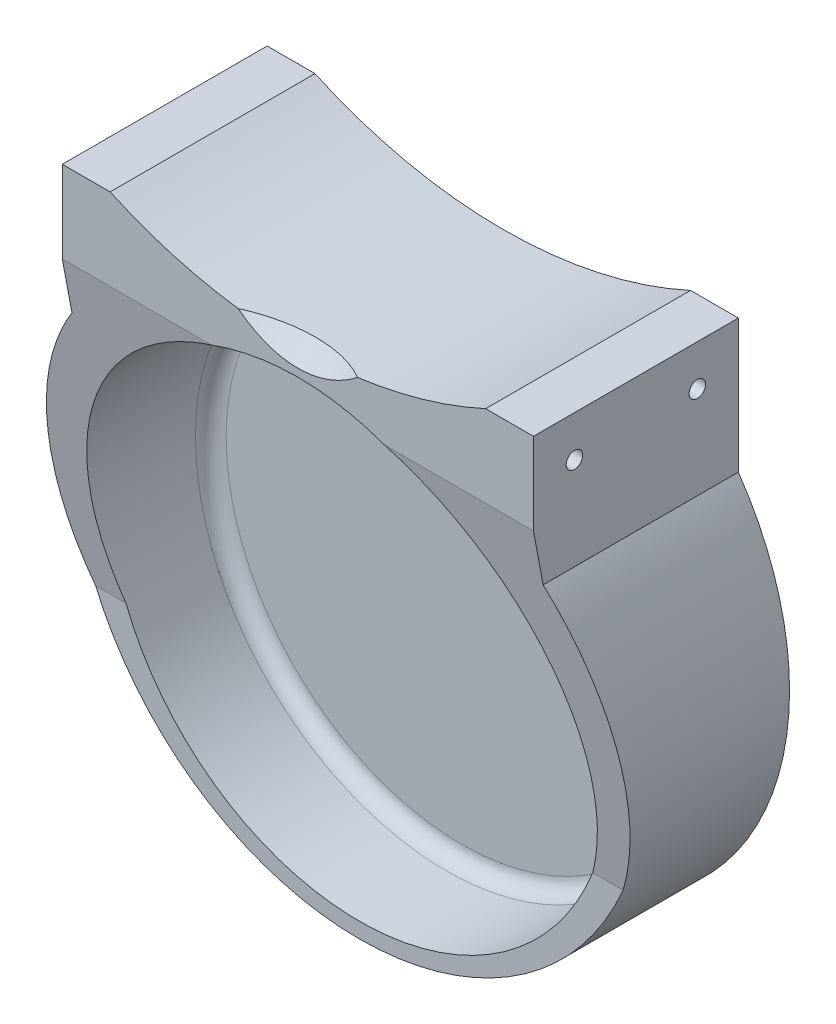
ISO-10303-21;
HEADER;
FILE_DESCRIPTION(('STEP AP214'),'2;1');
FILE_NAME('part.step','',(''),(''),'','','');
FILE_SCHEMA(('AUTOMOTIVE_DESIGN { 1 0 10303 214 1 1 1 1 }'));
ENDSEC;
DATA;
#1=APPLICATION_CONTEXT('core data for automotive mechanical design processes');
#2=APPLICATION_PROTOCOL_DEFINITION('international standard','automotive_design',2000,#1);
#3=PRODUCT_CONTEXT('',#1,'mechanical');
#4=PRODUCT('Part','Part','',(#3));
#5=PRODUCT_RELATED_PRODUCT_CATEGORY('part','',(#4));
#6=PRODUCT_DEFINITION_FORMATION('','',#4);
#7=PRODUCT_DEFINITION_CONTEXT('part definition',#1,'design');
#8=PRODUCT_DEFINITION('design','',#6,#7);
#9=PRODUCT_DEFINITION_SHAPE('','',#8);
#10=(LENGTH_UNIT() NAMED_UNIT(*) SI_UNIT(.MILLI.,.METRE.));
#11=(NAMED_UNIT(*) PLANE_ANGLE_UNIT() SI_UNIT($,.RADIAN.));
#12=(NAMED_UNIT(*) SI_UNIT($,.STERADIAN.) SOLID_ANGLE_UNIT());
#13=UNCERTAINTY_MEASURE_WITH_UNIT(LENGTH_MEASURE(1.E-05),#10,'distance_accuracy_value','');
#14=(GEOMETRIC_REPRESENTATION_CONTEXT(3) GLOBAL_UNCERTAINTY_ASSIGNED_CONTEXT((#13)) GLOBAL_UNIT_ASSIGNED_CONTEXT((#10,
#11,#12)) REPRESENTATION_CONTEXT('',''));
#15=CARTESIAN_POINT('',(0.,0.,0.));
#16=DIRECTION('',(0.,0.,1.));
#17=DIRECTION('',(1.,0.,0.));
#18=AXIS2_PLACEMENT_3D('',#15,#16,#17);
#19=CARTESIAN_POINT('',(0.,225.425,63.5));
#20=DIRECTION('',(0.,0.,-1.));
#21=DIRECTION('',(-1.,0.,0.));
#22=AXIS2_PLACEMENT_3D('',#19,#20,#21);
#23=CYLINDRICAL_SURFACE('',#22,139.7);
#24=CARTESIAN_POINT('',(18.4892893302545,86.9539337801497,63.5));
#25=CARTESIAN_POINT('',(18.0983778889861,86.9017353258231,63.2453553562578));
#26=CARTESIAN_POINT('',(17.7023084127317,86.8505373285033,62.9984136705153));
#27=CARTESIAN_POINT('',(16.9003627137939,86.7504497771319,62.5204614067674));
#28=CARTESIAN_POINT('',(16.4944860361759,86.7015603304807,62.2894515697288));
#29=CARTESIAN_POINT('',(15.6733590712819,86.6063892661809,61.8438508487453));
#30=CARTESIAN_POINT('',(15.2581062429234,86.5601083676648,61.6292644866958));
#31=CARTESIAN_POINT('',(14.418976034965,86.4704704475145,61.2170982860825));
#32=CARTESIAN_POINT('',(13.9950987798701,86.4271133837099,61.0195182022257));
#33=CARTESIAN_POINT('',(12.7108256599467,86.3018013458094,60.4527301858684));
#34=CARTESIAN_POINT('',(11.8382030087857,86.2246540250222,60.1096997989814));
#35=CARTESIAN_POINT('',(10.0666002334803,86.0853316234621,59.4970539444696));
#36=CARTESIAN_POINT('',(9.16762310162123,86.0231548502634,59.227430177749));
#37=CARTESIAN_POINT('',(7.34738700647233,85.9153637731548,58.7636623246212));
#38=CARTESIAN_POINT('',(6.42608580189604,85.8697839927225,58.5696755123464));
#39=CARTESIAN_POINT('',(4.5696641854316,85.7966679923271,58.2599367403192));
#40=CARTESIAN_POINT('',(3.63454310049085,85.769132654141,58.1441886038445));
#41=CARTESIAN_POINT('',(1.75830464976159,85.7329173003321,57.9921733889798));
#42=CARTESIAN_POINT('',(0.81719315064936,85.7242210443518,57.9558378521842));
#43=CARTESIAN_POINT('',(-1.06467513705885,85.725888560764,57.9628167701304));
#44=CARTESIAN_POINT('',(-2.00543194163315,85.7362513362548,58.0061270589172));
#45=CARTESIAN_POINT('',(-3.854869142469,85.7752130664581,58.1697624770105));
#46=CARTESIAN_POINT('',(-4.76374257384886,85.8033253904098,58.2880327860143));
#47=CARTESIAN_POINT('',(-6.56812619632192,85.8765674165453,58.5985395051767));
#48=CARTESIAN_POINT('',(-7.46363556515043,85.9216981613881,58.7907804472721));
#49=CARTESIAN_POINT('',(-9.23509271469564,86.0277595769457,59.2473915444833));
#50=CARTESIAN_POINT('',(-10.1110398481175,86.0886907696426,59.5117640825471));
#51=CARTESIAN_POINT('',(-11.837486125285,86.224736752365,60.110126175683));
#52=CARTESIAN_POINT('',(-12.6879926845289,86.2998473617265,60.4440952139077));
#53=CARTESIAN_POINT('',(-13.9554902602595,86.4231172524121,61.0013467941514));
#54=CARTESIAN_POINT('',(-14.3837682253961,86.4668083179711,61.2003504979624));
#55=CARTESIAN_POINT('',(-15.2315471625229,86.5571794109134,61.6157120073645));
#56=CARTESIAN_POINT('',(-15.6510479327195,86.6038595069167,61.8320702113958));
#57=CARTESIAN_POINT('',(-16.4794998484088,86.69976977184,62.2810069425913));
#58=CARTESIAN_POINT('',(-16.8884762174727,86.7489927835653,62.5135405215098));
#59=CARTESIAN_POINT('',(-17.6964760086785,86.8497834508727,62.9947777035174));
#60=CARTESIAN_POINT('',(-18.0954999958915,86.9013509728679,63.2434803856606));
#61=CARTESIAN_POINT('',(-18.4892893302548,86.9539337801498,63.5));
#62=B_SPLINE_CURVE_WITH_KNOTS('',3,(#24,#25,#26,#27,#28,#29,#30,#31,#32,#33,#34,#35,#36,#37,#38,
#39,#40,#41,#42,#43,#44,#45,#46,#47,#48,#49,#50,#51,#52,#53,#54,#55,#56,#57,#58,#59,#60,#61),
.UNSPECIFIED.,.F.,.F.,(4,2,2,2,2,2,2,2,2,2,2,2,2,2,2,2,2,2,4),(0.,1.40825427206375,
2.81657399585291,4.22528008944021,5.63396586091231,8.452756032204,11.271227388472,
14.095528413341,16.9199674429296,19.7419706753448,22.5638263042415,25.3114894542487,
28.0593209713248,30.8072432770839,33.5543566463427,34.9768322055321,36.399340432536,
37.8180425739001,39.2366639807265),.UNSPECIFIED.);
#63=CARTESIAN_POINT('',(18.4892893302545,86.9539337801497,63.5));
#64=VERTEX_POINT('',#63);
#65=CARTESIAN_POINT('',(-18.4892893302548,86.9539337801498,63.5));
#66=VERTEX_POINT('',#65);
#67=EDGE_CURVE('E11',#64,#66,#62,.T.);
#68=ORIENTED_EDGE('',*,*,#67,.F.);
#69=CARTESIAN_POINT('',(0.,225.425,63.5));
#70=DIRECTION('',(0.,0.,-1.));
#71=DIRECTION('',(-1.,0.,0.));
#72=AXIS2_PLACEMENT_3D('',#69,#70,#71);
#73=CIRCLE('',#72,139.7);
#74=CARTESIAN_POINT('',(58.1987113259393,98.425,63.5));
#75=VERTEX_POINT('',#74);
#76=EDGE_CURVE('E145',#75,#64,#73,.T.);
#77=ORIENTED_EDGE('',*,*,#76,.F.);
#78=DIRECTION('',(0.,0.,-1.));
#79=VECTOR('',#78,1.);
#80=CARTESIAN_POINT('',(58.1987113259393,98.425,63.5));
#81=LINE('',#80,#79);
#82=CARTESIAN_POINT('',(58.1987113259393,98.425,0.));
#83=VERTEX_POINT('',#82);
#84=EDGE_CURVE('E221',#83,#75,#81,.F.);
#85=ORIENTED_EDGE('',*,*,#84,.F.);
#86=CARTESIAN_POINT('',(0.,225.425,0.));
#87=DIRECTION('',(0.,0.,-1.));
#88=DIRECTION('',(-1.,0.,0.));
#89=AXIS2_PLACEMENT_3D('',#86,#87,#88);
#90=CIRCLE('',#89,139.7);
#91=CARTESIAN_POINT('',(-58.1987113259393,98.425,0.));
#92=VERTEX_POINT('',#91);
#93=EDGE_CURVE('E151',#83,#92,#90,.T.);
#94=ORIENTED_EDGE('',*,*,#93,.T.);
#95=DIRECTION('',(0.,0.,-1.));
#96=VECTOR('',#95,1.);
#97=CARTESIAN_POINT('',(-58.1987113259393,98.425,63.5));
#98=LINE('',#97,#96);
#99=CARTESIAN_POINT('',(-58.1987113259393,98.425,63.5));
#100=VERTEX_POINT('',#99);
#101=EDGE_CURVE('E149',#100,#92,#98,.T.);
#102=ORIENTED_EDGE('',*,*,#101,.F.);
#103=EDGE_CURVE('E142',#66,#100,#73,.T.);
#104=ORIENTED_EDGE('',*,*,#103,.F.);
#105=EDGE_LOOP('',(#68,#77,#85,#94,#102,#104));
#106=FACE_BOUND('',#105,.T.);
#107=ADVANCED_FACE('F39',(#106),#23,.F.);
#108=CARTESIAN_POINT('',(0.,6.34999999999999,63.5));
#109=DIRECTION('',(0.,0.,-1.));
#110=DIRECTION('',(-1.,0.,0.));
#111=AXIS2_PLACEMENT_3D('',#108,#109,#110);
#112=CYLINDRICAL_SURFACE('',#111,88.9);
#113=CARTESIAN_POINT('',(0.,6.34999999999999,50.9984375));
#114=DIRECTION('',(0.,0.184288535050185,-0.982872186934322));
#115=DIRECTION('',(0.,-0.982872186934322,-0.184288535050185));
#116=AXIS2_PLACEMENT_3D('',#113,#114,#115);
#117=ELLIPSE('',#116,90.449196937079,88.9);
#118=CARTESIAN_POINT('',(-81.7523967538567,-28.575,44.45));
#119=VERTEX_POINT('',#118);
#120=CARTESIAN_POINT('',(-73.025,57.0506841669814,60.504815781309));
#121=VERTEX_POINT('',#120);
#122=EDGE_CURVE('E230',#119,#121,#117,.T.);
#123=ORIENTED_EDGE('',*,*,#122,.T.);
#124=DIRECTION('',(0.,0.,-1.));
#125=VECTOR('',#124,1.);
#126=CARTESIAN_POINT('',(-73.025,57.0506841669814,63.5));
#127=LINE('',#126,#125);
#128=CARTESIAN_POINT('',(-73.025,57.0506841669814,0.));
#129=VERTEX_POINT('',#128);
#130=EDGE_CURVE('E210',#121,#129,#127,.T.);
#131=ORIENTED_EDGE('',*,*,#130,.T.);
#132=CARTESIAN_POINT('',(0.,6.34999999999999,0.));
#133=DIRECTION('',(0.,0.,1.));
#134=DIRECTION('',(1.,0.,0.));
#135=AXIS2_PLACEMENT_3D('',#132,#133,#134);
#136=CIRCLE('',#135,88.9);
#137=CARTESIAN_POINT('',(73.025,57.0506841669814,0.));
#138=VERTEX_POINT('',#137);
#139=EDGE_CURVE('E201',#129,#138,#136,.T.);
#140=ORIENTED_EDGE('',*,*,#139,.T.);
#141=DIRECTION('',(0.,0.,-1.));
#142=VECTOR('',#141,1.);
#143=CARTESIAN_POINT('',(73.025,57.0506841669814,63.5));
#144=LINE('',#143,#142);
#145=CARTESIAN_POINT('',(73.025,57.0506841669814,60.504815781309));
#146=VERTEX_POINT('',#145);
#147=EDGE_CURVE('E208',#146,#138,#144,.T.);
#148=ORIENTED_EDGE('',*,*,#147,.F.);
#149=CARTESIAN_POINT('',(81.7523967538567,-28.575,44.45));
#150=VERTEX_POINT('',#149);
#151=EDGE_CURVE('E66',#146,#150,#117,.T.);
#152=ORIENTED_EDGE('',*,*,#151,.T.);
#153=CARTESIAN_POINT('',(0.,6.34999999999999,44.45));
#154=DIRECTION('',(0.,0.,-1.));
#155=DIRECTION('',(0.,1.,0.));
#156=AXIS2_PLACEMENT_3D('',#153,#154,#155);
#157=CIRCLE('',#156,88.9);
#158=EDGE_CURVE('E53',#150,#119,#157,.T.);
#159=ORIENTED_EDGE('',*,*,#158,.T.);
#160=EDGE_LOOP('',(#123,#131,#140,#148,#152,#159));
#161=FACE_BOUND('',#160,.T.);
#162=ADVANCED_FACE('F229',(#161),#112,.T.);
#163=CARTESIAN_POINT('',(-73.025,98.425,63.5));
#164=DIRECTION('',(0.,-1.,0.));
#165=DIRECTION('',(0.,0.,-1.));
#166=AXIS2_PLACEMENT_3D('',#163,#164,#165);
#167=PLANE('',#166);
#168=DIRECTION('',(-1.,0.,0.));
#169=VECTOR('',#168,1.);
#170=CARTESIAN_POINT('',(-73.025,98.425,63.5));
#171=LINE('',#170,#169);
#172=CARTESIAN_POINT('',(-73.025,98.425,63.5));
#173=VERTEX_POINT('',#172);
#174=EDGE_CURVE('E189',#100,#173,#171,.T.);
#175=ORIENTED_EDGE('',*,*,#174,.F.);
#176=ORIENTED_EDGE('',*,*,#101,.T.);
#177=DIRECTION('',(-1.,0.,0.));
#178=VECTOR('',#177,1.);
#179=CARTESIAN_POINT('',(-73.025,98.425,0.));
#180=LINE('',#179,#178);
#181=CARTESIAN_POINT('',(-73.025,98.425,0.));
#182=VERTEX_POINT('',#181);
#183=EDGE_CURVE('E185',#92,#182,#180,.T.);
#184=ORIENTED_EDGE('',*,*,#183,.T.);
#185=DIRECTION('',(0.,0.,-1.));
#186=VECTOR('',#185,1.);
#187=CARTESIAN_POINT('',(-73.025,98.425,63.5));
#188=LINE('',#187,#186);
#189=EDGE_CURVE('E212',#173,#182,#188,.T.);
#190=ORIENTED_EDGE('',*,*,#189,.F.);
#191=EDGE_LOOP('',(#175,#176,#184,#190));
#192=FACE_BOUND('',#191,.T.);
#193=ADVANCED_FACE('F282',(#192),#167,.F.);
#194=CARTESIAN_POINT('',(0.,0.,63.5));
#195=DIRECTION('',(0.,0.,-1.));
#196=DIRECTION('',(-1.,0.,0.));
#197=AXIS2_PLACEMENT_3D('',#194,#195,#196);
#198=CYLINDRICAL_SURFACE('',#197,77.7875);
#199=CARTESIAN_POINT('',(0.,0.,49.8078125));
#200=DIRECTION('',(0.,0.184288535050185,-0.982872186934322));
#201=DIRECTION('',(0.,-0.982872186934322,-0.184288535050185));
#202=AXIS2_PLACEMENT_3D('',#199,#200,#201);
#203=ELLIPSE('',#202,79.1430473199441,77.7875);
#204=CARTESIAN_POINT('',(-72.3489082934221,-28.575,44.45));
#205=VERTEX_POINT('',#204);
#206=CARTESIAN_POINT('',(-26.8000845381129,73.025,63.5));
#207=VERTEX_POINT('',#206);
#208=EDGE_CURVE('E251',#205,#207,#203,.T.);
#209=ORIENTED_EDGE('',*,*,#208,.F.);
#210=CARTESIAN_POINT('',(0.,0.,44.45));
#211=DIRECTION('',(0.,0.,-1.));
#212=DIRECTION('',(0.,1.,0.));
#213=AXIS2_PLACEMENT_3D('',#210,#211,#212);
#214=CIRCLE('',#213,77.7875);
#215=CARTESIAN_POINT('',(72.3489082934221,-28.575,44.45));
#216=VERTEX_POINT('',#215);
#217=EDGE_CURVE('E154',#216,#205,#214,.T.);
#218=ORIENTED_EDGE('',*,*,#217,.F.);
#219=CARTESIAN_POINT('',(26.8000845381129,73.025,63.5));
#220=VERTEX_POINT('',#219);
#221=EDGE_CURVE('E242',#220,#216,#203,.T.);
#222=ORIENTED_EDGE('',*,*,#221,.F.);
#223=CARTESIAN_POINT('',(0.,0.,63.5));
#224=DIRECTION('',(0.,0.,1.));
#225=DIRECTION('',(1.,0.,0.));
#226=AXIS2_PLACEMENT_3D('',#223,#224,#225);
#227=CIRCLE('',#226,77.7875);
#228=EDGE_CURVE('E182',#220,#207,#227,.T.);
#229=ORIENTED_EDGE('',*,*,#228,.T.);
#230=EDGE_LOOP('',(#209,#218,#222,#229));
#231=FACE_BOUND('',#230,.T.);
#232=CARTESIAN_POINT('',(0.,0.,17.4625));
#233=DIRECTION('',(0.,0.,-1.));
#234=DIRECTION('',(-1.,0.,0.));
#235=AXIS2_PLACEMENT_3D('',#232,#233,#234);
#236=CIRCLE('',#235,77.7875);
#237=CARTESIAN_POINT('',(-77.7875,0.,17.4625));
#238=VERTEX_POINT('',#237);
#239=EDGE_CURVE('E215',#238,#238,#236,.T.);
#240=ORIENTED_EDGE('',*,*,#239,.T.);
#241=EDGE_LOOP('',(#240));
#242=FACE_BOUND('',#241,.T.);
#243=ADVANCED_FACE('F257',(#231,#242),#198,.F.);
#244=CARTESIAN_POINT('',(0.,6.34999999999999,63.5));
#245=DIRECTION('',(0.,0.,1.));
#246=DIRECTION('',(1.,0.,0.));
#247=AXIS2_PLACEMENT_3D('',#244,#245,#246);
#248=PLANE('',#247);
#249=ORIENTED_EDGE('',*,*,#76,.T.);
#250=CARTESIAN_POINT('',(-1.4259720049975E-13,134.065634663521,63.5));
#251=DIRECTION('',(0.,0.,1.));
#252=DIRECTION('',(0.,1.,0.));
#253=AXIS2_PLACEMENT_3D('',#250,#251,#252);
#254=ELLIPSE('',#253,53.8815367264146,38.1);
#255=EDGE_CURVE('E58',#64,#66,#254,.F.);
#256=ORIENTED_EDGE('',*,*,#255,.T.);
#257=ORIENTED_EDGE('',*,*,#103,.T.);
#258=ORIENTED_EDGE('',*,*,#174,.T.);
#259=DIRECTION('',(0.,-1.,0.));
#260=VECTOR('',#259,1.);
#261=CARTESIAN_POINT('',(-73.025,57.0506841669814,63.5));
#262=LINE('',#261,#260);
#263=CARTESIAN_POINT('',(-73.025,73.025,63.5));
#264=VERTEX_POINT('',#263);
#265=EDGE_CURVE('E188',#173,#264,#262,.T.);
#266=ORIENTED_EDGE('',*,*,#265,.T.);
#267=DIRECTION('',(1.,0.,0.));
#268=VECTOR('',#267,1.);
#269=CARTESIAN_POINT('',(-88.9,73.025,63.5));
#270=LINE('',#269,#268);
#271=EDGE_CURVE('E248',#264,#207,#270,.T.);
#272=ORIENTED_EDGE('',*,*,#271,.T.);
#273=ORIENTED_EDGE('',*,*,#228,.F.);
#274=CARTESIAN_POINT('',(73.025,73.025,63.5));
#275=VERTEX_POINT('',#274);
#276=EDGE_CURVE('E244',#220,#275,#270,.T.);
#277=ORIENTED_EDGE('',*,*,#276,.T.);
#278=DIRECTION('',(0.,1.,0.));
#279=VECTOR('',#278,1.);
#280=CARTESIAN_POINT('',(73.025,57.0506841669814,63.5));
#281=LINE('',#280,#279);
#282=CARTESIAN_POINT('',(73.025,98.425,63.5));
#283=VERTEX_POINT('',#282);
#284=EDGE_CURVE('E192',#275,#283,#281,.T.);
#285=ORIENTED_EDGE('',*,*,#284,.T.);
#286=EDGE_CURVE('E186',#283,#75,#171,.T.);
#287=ORIENTED_EDGE('',*,*,#286,.T.);
#288=EDGE_LOOP('',(#249,#256,#257,#258,#266,#272,#273,#277,#285,#287));
#289=FACE_BOUND('',#288,.T.);
#290=ADVANCED_FACE('F141',(#289),#248,.T.);
#291=CARTESIAN_POINT('',(0.,6.34999999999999,0.));
#292=DIRECTION('',(0.,0.,1.));
#293=DIRECTION('',(1.,0.,0.));
#294=AXIS2_PLACEMENT_3D('',#291,#292,#293);
#295=PLANE('',#294);
#296=ORIENTED_EDGE('',*,*,#183,.F.);
#297=ORIENTED_EDGE('',*,*,#93,.F.);
#298=CARTESIAN_POINT('',(73.025,98.425,0.));
#299=VERTEX_POINT('',#298);
#300=EDGE_CURVE('E195',#299,#83,#180,.T.);
#301=ORIENTED_EDGE('',*,*,#300,.F.);
#302=DIRECTION('',(0.,1.,0.));
#303=VECTOR('',#302,1.);
#304=CARTESIAN_POINT('',(73.025,57.0506841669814,0.));
#305=LINE('',#304,#303);
#306=EDGE_CURVE('E204',#138,#299,#305,.T.);
#307=ORIENTED_EDGE('',*,*,#306,.F.);
#308=ORIENTED_EDGE('',*,*,#139,.F.);
#309=DIRECTION('',(0.,-1.,0.));
#310=VECTOR('',#309,1.);
#311=CARTESIAN_POINT('',(-73.025,57.0506841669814,0.));
#312=LINE('',#311,#310);
#313=EDGE_CURVE('E198',#182,#129,#312,.T.);
#314=ORIENTED_EDGE('',*,*,#313,.F.);
#315=EDGE_LOOP('',(#296,#297,#301,#307,#308,#314));
#316=FACE_BOUND('',#315,.T.);
#317=ADVANCED_FACE('F273',(#316),#295,.F.);
#318=ORIENTED_EDGE('',*,*,#300,.T.);
#319=ORIENTED_EDGE('',*,*,#84,.T.);
#320=ORIENTED_EDGE('',*,*,#286,.F.);
#321=DIRECTION('',(0.,0.,-1.));
#322=VECTOR('',#321,1.);
#323=CARTESIAN_POINT('',(73.025,98.425,63.5));
#324=LINE('',#323,#322);
#325=EDGE_CURVE('E194',#283,#299,#324,.T.);
#326=ORIENTED_EDGE('',*,*,#325,.T.);
#327=EDGE_LOOP('',(#318,#319,#320,#326));
#328=FACE_BOUND('',#327,.T.);
#329=ADVANCED_FACE('F280',(#328),#167,.F.);
#330=CARTESIAN_POINT('',(-73.025,57.0506841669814,63.5));
#331=DIRECTION('',(1.,0.,0.));
#332=DIRECTION('',(0.,0.,-1.));
#333=AXIS2_PLACEMENT_3D('',#330,#331,#332);
#334=PLANE('',#333);
#335=CARTESIAN_POINT('',(-73.025,85.725,12.7));
#336=DIRECTION('',(-1.,0.,0.));
#337=DIRECTION('',(0.,0.,1.));
#338=AXIS2_PLACEMENT_3D('',#335,#336,#337);
#339=CIRCLE('',#338,2.55269999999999);
#340=CARTESIAN_POINT('',(-73.025,85.725,15.2527));
#341=VERTEX_POINT('',#340);
#342=EDGE_CURVE('E170',#341,#341,#339,.T.);
#343=ORIENTED_EDGE('',*,*,#342,.F.);
#344=EDGE_LOOP('',(#343));
#345=FACE_BOUND('',#344,.T.);
#346=CARTESIAN_POINT('',(-73.025,85.725,50.8));
#347=DIRECTION('',(-1.,0.,0.));
#348=DIRECTION('',(0.,0.,1.));
#349=AXIS2_PLACEMENT_3D('',#346,#347,#348);
#350=CIRCLE('',#349,2.55269999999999);
#351=CARTESIAN_POINT('',(-73.025,85.725,53.3527));
#352=VERTEX_POINT('',#351);
#353=EDGE_CURVE('E176',#352,#352,#350,.T.);
#354=ORIENTED_EDGE('',*,*,#353,.F.);
#355=EDGE_LOOP('',(#354));
#356=FACE_BOUND('',#355,.T.);
#357=ORIENTED_EDGE('',*,*,#130,.F.);
#358=DIRECTION('',(0.,0.982872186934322,0.184288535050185));
#359=VECTOR('',#358,1.);
#360=CARTESIAN_POINT('',(-73.025,57.593208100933,60.6065390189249));
#361=LINE('',#360,#359);
#362=EDGE_CURVE('E249',#121,#264,#361,.T.);
#363=ORIENTED_EDGE('',*,*,#362,.T.);
#364=ORIENTED_EDGE('',*,*,#265,.F.);
#365=ORIENTED_EDGE('',*,*,#189,.T.);
#366=ORIENTED_EDGE('',*,*,#313,.T.);
#367=EDGE_LOOP('',(#357,#363,#364,#365,#366));
#368=FACE_BOUND('',#367,.T.);
#369=ADVANCED_FACE('F265',(#345,#356,#368),#334,.F.);
#370=CARTESIAN_POINT('',(73.025,57.0506841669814,63.5));
#371=DIRECTION('',(-1.,0.,0.));
#372=DIRECTION('',(0.,0.,1.));
#373=AXIS2_PLACEMENT_3D('',#370,#371,#372);
#374=PLANE('',#373);
#375=CARTESIAN_POINT('',(73.025,85.725,12.7));
#376=DIRECTION('',(1.,0.,0.));
#377=DIRECTION('',(0.,0.,-1.));
#378=AXIS2_PLACEMENT_3D('',#375,#376,#377);
#379=CIRCLE('',#378,2.55269999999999);
#380=CARTESIAN_POINT('',(73.025,85.725,10.1473));
#381=VERTEX_POINT('',#380);
#382=EDGE_CURVE('E153',#381,#381,#379,.T.);
#383=ORIENTED_EDGE('',*,*,#382,.F.);
#384=EDGE_LOOP('',(#383));
#385=FACE_BOUND('',#384,.T.);
#386=CARTESIAN_POINT('',(73.025,85.725,50.8));
#387=DIRECTION('',(1.,0.,0.));
#388=DIRECTION('',(0.,0.,-1.));
#389=AXIS2_PLACEMENT_3D('',#386,#387,#388);
#390=CIRCLE('',#389,2.55269999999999);
#391=CARTESIAN_POINT('',(73.025,85.725,48.2473));
#392=VERTEX_POINT('',#391);
#393=EDGE_CURVE('E164',#392,#392,#390,.T.);
#394=ORIENTED_EDGE('',*,*,#393,.F.);
#395=EDGE_LOOP('',(#394));
#396=FACE_BOUND('',#395,.T.);
#397=ORIENTED_EDGE('',*,*,#284,.F.);
#398=DIRECTION('',(0.,-0.982872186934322,-0.184288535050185));
#399=VECTOR('',#398,1.);
#400=CARTESIAN_POINT('',(73.025,57.593208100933,60.6065390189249));
#401=LINE('',#400,#399);
#402=EDGE_CURVE('E225',#275,#146,#401,.T.);
#403=ORIENTED_EDGE('',*,*,#402,.T.);
#404=ORIENTED_EDGE('',*,*,#147,.T.);
#405=ORIENTED_EDGE('',*,*,#306,.T.);
#406=ORIENTED_EDGE('',*,*,#325,.F.);
#407=EDGE_LOOP('',(#397,#403,#404,#405,#406));
#408=FACE_BOUND('',#407,.T.);
#409=ADVANCED_FACE('F277',(#385,#396,#408),#374,.F.);
#410=CARTESIAN_POINT('',(0.,0.,12.7));
#411=DIRECTION('',(0.,0.,-1.));
#412=DIRECTION('',(-1.,0.,0.));
#413=AXIS2_PLACEMENT_3D('',#410,#411,#412);
#414=PLANE('',#413);
#415=CARTESIAN_POINT('',(0.,0.,12.7));
#416=DIRECTION('',(0.,0.,-1.));
#417=DIRECTION('',(-1.,0.,0.));
#418=AXIS2_PLACEMENT_3D('',#415,#416,#417);
#419=CIRCLE('',#418,73.025);
#420=CARTESIAN_POINT('',(-73.025,0.,12.7));
#421=VERTEX_POINT('',#420);
#422=EDGE_CURVE('E218',#421,#421,#419,.F.);
#423=ORIENTED_EDGE('',*,*,#422,.T.);
#424=EDGE_LOOP('',(#423));
#425=FACE_BOUND('',#424,.T.);
#426=ADVANCED_FACE('F331',(#425),#414,.F.);
#427=CARTESIAN_POINT('',(0.,0.,17.4625));
#428=DIRECTION('',(0.,0.,-1.));
#429=DIRECTION('',(-1.,0.,0.));
#430=AXIS2_PLACEMENT_3D('',#427,#428,#429);
#431=TOROIDAL_SURFACE('',#430,73.025,4.7625);
#432=ORIENTED_EDGE('',*,*,#422,.F.);
#433=EDGE_LOOP('',(#432));
#434=FACE_BOUND('',#433,.T.);
#435=ORIENTED_EDGE('',*,*,#239,.F.);
#436=EDGE_LOOP('',(#435));
#437=FACE_BOUND('',#436,.T.);
#438=ADVANCED_FACE('F41',(#434,#437),#431,.F.);
#439=CARTESIAN_POINT('',(-41.275,85.725,50.8));
#440=DIRECTION('',(-1.,0.,0.));
#441=DIRECTION('',(0.,0.,1.));
#442=AXIS2_PLACEMENT_3D('',#439,#440,#441);
#443=CONICAL_SURFACE('',#442,2.55269999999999,1.02974425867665);
#444=CARTESIAN_POINT('',(-39.7411830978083,85.725,50.8));
#445=VERTEX_POINT('',#444);
#446=VERTEX_LOOP('',#445);
#447=FACE_BOUND('',#446,.T.);
#448=CARTESIAN_POINT('',(-41.275,85.725,50.8));
#449=DIRECTION('',(-1.,0.,0.));
#450=DIRECTION('',(0.,0.,1.));
#451=AXIS2_PLACEMENT_3D('',#448,#449,#450);
#452=CIRCLE('',#451,2.55269999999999);
#453=CARTESIAN_POINT('',(-41.275,85.725,53.3527));
#454=VERTEX_POINT('',#453);
#455=EDGE_CURVE('E179',#454,#454,#452,.T.);
#456=ORIENTED_EDGE('',*,*,#455,.T.);
#457=EDGE_LOOP('',(#456));
#458=FACE_BOUND('',#457,.T.);
#459=ADVANCED_FACE('F326',(#447,#458),#443,.F.);
#460=CARTESIAN_POINT('',(-73.025,85.725,50.8));
#461=DIRECTION('',(-1.,0.,0.));
#462=DIRECTION('',(0.,0.,1.));
#463=AXIS2_PLACEMENT_3D('',#460,#461,#462);
#464=CYLINDRICAL_SURFACE('',#463,2.55269999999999);
#465=ORIENTED_EDGE('',*,*,#455,.F.);
#466=EDGE_LOOP('',(#465));
#467=FACE_BOUND('',#466,.T.);
#468=ORIENTED_EDGE('',*,*,#353,.T.);
#469=EDGE_LOOP('',(#468));
#470=FACE_BOUND('',#469,.T.);
#471=ADVANCED_FACE('F322',(#467,#470),#464,.F.);
#472=CARTESIAN_POINT('',(-41.275,85.725,12.7));
#473=DIRECTION('',(-1.,0.,0.));
#474=DIRECTION('',(0.,0.,1.));
#475=AXIS2_PLACEMENT_3D('',#472,#473,#474);
#476=CONICAL_SURFACE('',#475,2.55269999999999,1.02974425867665);
#477=CARTESIAN_POINT('',(-39.7411830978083,85.725,12.7));
#478=VERTEX_POINT('',#477);
#479=VERTEX_LOOP('',#478);
#480=FACE_BOUND('',#479,.T.);
#481=CARTESIAN_POINT('',(-41.275,85.725,12.7));
#482=DIRECTION('',(-1.,0.,0.));
#483=DIRECTION('',(0.,0.,1.));
#484=AXIS2_PLACEMENT_3D('',#481,#482,#483);
#485=CIRCLE('',#484,2.55269999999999);
#486=CARTESIAN_POINT('',(-41.275,85.725,15.2527));
#487=VERTEX_POINT('',#486);
#488=EDGE_CURVE('E173',#487,#487,#485,.T.);
#489=ORIENTED_EDGE('',*,*,#488,.T.);
#490=EDGE_LOOP('',(#489));
#491=FACE_BOUND('',#490,.T.);
#492=ADVANCED_FACE('F318',(#480,#491),#476,.F.);
#493=CARTESIAN_POINT('',(-73.025,85.725,12.7));
#494=DIRECTION('',(-1.,0.,0.));
#495=DIRECTION('',(0.,0.,1.));
#496=AXIS2_PLACEMENT_3D('',#493,#494,#495);
#497=CYLINDRICAL_SURFACE('',#496,2.55269999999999);
#498=ORIENTED_EDGE('',*,*,#488,.F.);
#499=EDGE_LOOP('',(#498));
#500=FACE_BOUND('',#499,.T.);
#501=ORIENTED_EDGE('',*,*,#342,.T.);
#502=EDGE_LOOP('',(#501));
#503=FACE_BOUND('',#502,.T.);
#504=ADVANCED_FACE('F314',(#500,#503),#497,.F.);
#505=CARTESIAN_POINT('',(41.275,85.725,50.8));
#506=DIRECTION('',(1.,0.,0.));
#507=DIRECTION('',(0.,0.,-1.));
#508=AXIS2_PLACEMENT_3D('',#505,#506,#507);
#509=CONICAL_SURFACE('',#508,2.55269999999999,1.02974425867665);
#510=CARTESIAN_POINT('',(39.7411830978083,85.725,50.8));
#511=VERTEX_POINT('',#510);
#512=VERTEX_LOOP('',#511);
#513=FACE_BOUND('',#512,.T.);
#514=CARTESIAN_POINT('',(41.275,85.725,50.8));
#515=DIRECTION('',(1.,0.,0.));
#516=DIRECTION('',(0.,0.,-1.));
#517=AXIS2_PLACEMENT_3D('',#514,#515,#516);
#518=CIRCLE('',#517,2.55269999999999);
#519=CARTESIAN_POINT('',(41.275,85.725,48.2473));
#520=VERTEX_POINT('',#519);
#521=EDGE_CURVE('E167',#520,#520,#518,.T.);
#522=ORIENTED_EDGE('',*,*,#521,.T.);
#523=EDGE_LOOP('',(#522));
#524=FACE_BOUND('',#523,.T.);
#525=ADVANCED_FACE('F310',(#513,#524),#509,.F.);
#526=CARTESIAN_POINT('',(73.025,85.725,50.8));
#527=DIRECTION('',(1.,0.,0.));
#528=DIRECTION('',(0.,0.,-1.));
#529=AXIS2_PLACEMENT_3D('',#526,#527,#528);
#530=CYLINDRICAL_SURFACE('',#529,2.55269999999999);
#531=ORIENTED_EDGE('',*,*,#521,.F.);
#532=EDGE_LOOP('',(#531));
#533=FACE_BOUND('',#532,.T.);
#534=ORIENTED_EDGE('',*,*,#393,.T.);
#535=EDGE_LOOP('',(#534));
#536=FACE_BOUND('',#535,.T.);
#537=ADVANCED_FACE('F306',(#533,#536),#530,.F.);
#538=CARTESIAN_POINT('',(41.275,85.725,12.7));
#539=DIRECTION('',(1.,0.,0.));
#540=DIRECTION('',(0.,0.,-1.));
#541=AXIS2_PLACEMENT_3D('',#538,#539,#540);
#542=CONICAL_SURFACE('',#541,2.55269999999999,1.02974425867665);
#543=CARTESIAN_POINT('',(39.7411830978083,85.725,12.7));
#544=VERTEX_POINT('',#543);
#545=VERTEX_LOOP('',#544);
#546=FACE_BOUND('',#545,.T.);
#547=CARTESIAN_POINT('',(41.275,85.725,12.7));
#548=DIRECTION('',(1.,0.,0.));
#549=DIRECTION('',(0.,0.,-1.));
#550=AXIS2_PLACEMENT_3D('',#547,#548,#549);
#551=CIRCLE('',#550,2.55269999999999);
#552=CARTESIAN_POINT('',(41.275,85.725,10.1473));
#553=VERTEX_POINT('',#552);
#554=EDGE_CURVE('E161',#553,#553,#551,.T.);
#555=ORIENTED_EDGE('',*,*,#554,.T.);
#556=EDGE_LOOP('',(#555));
#557=FACE_BOUND('',#556,.T.);
#558=ADVANCED_FACE('F302',(#546,#557),#542,.F.);
#559=CARTESIAN_POINT('',(73.025,85.725,12.7));
#560=DIRECTION('',(1.,0.,0.));
#561=DIRECTION('',(0.,0.,-1.));
#562=AXIS2_PLACEMENT_3D('',#559,#560,#561);
#563=CYLINDRICAL_SURFACE('',#562,2.55269999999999);
#564=ORIENTED_EDGE('',*,*,#554,.F.);
#565=EDGE_LOOP('',(#564));
#566=FACE_BOUND('',#565,.T.);
#567=ORIENTED_EDGE('',*,*,#382,.T.);
#568=EDGE_LOOP('',(#567));
#569=FACE_BOUND('',#568,.T.);
#570=ADVANCED_FACE('F299',(#566,#569),#563,.F.);
#571=CARTESIAN_POINT('',(-88.9,-28.575,44.45));
#572=DIRECTION('',(0.,0.,-1.));
#573=DIRECTION('',(0.,1.,0.));
#574=AXIS2_PLACEMENT_3D('',#571,#572,#573);
#575=PLANE('',#574);
#576=ORIENTED_EDGE('',*,*,#217,.T.);
#577=DIRECTION('',(1.,0.,0.));
#578=VECTOR('',#577,1.);
#579=CARTESIAN_POINT('',(-88.9,-28.575,44.45));
#580=LINE('',#579,#578);
#581=EDGE_CURVE('E239',#119,#205,#580,.T.);
#582=ORIENTED_EDGE('',*,*,#581,.F.);
#583=ORIENTED_EDGE('',*,*,#158,.F.);
#584=EDGE_CURVE('E146',#216,#150,#580,.T.);
#585=ORIENTED_EDGE('',*,*,#584,.F.);
#586=EDGE_LOOP('',(#576,#582,#583,#585));
#587=FACE_BOUND('',#586,.T.);
#588=ADVANCED_FACE('F236',(#587),#575,.F.);
#589=CARTESIAN_POINT('',(-88.9,73.025,63.5));
#590=DIRECTION('',(0.,0.184288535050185,-0.982872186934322));
#591=DIRECTION('',(0.,0.982872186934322,0.184288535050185));
#592=AXIS2_PLACEMENT_3D('',#589,#590,#591);
#593=PLANE('',#592);
#594=ORIENTED_EDGE('',*,*,#208,.T.);
#595=ORIENTED_EDGE('',*,*,#271,.F.);
#596=ORIENTED_EDGE('',*,*,#362,.F.);
#597=ORIENTED_EDGE('',*,*,#122,.F.);
#598=ORIENTED_EDGE('',*,*,#581,.T.);
#599=EDGE_LOOP('',(#594,#595,#596,#597,#598));
#600=FACE_BOUND('',#599,.T.);
#601=ADVANCED_FACE('F256',(#600),#593,.F.);
#602=ORIENTED_EDGE('',*,*,#221,.T.);
#603=ORIENTED_EDGE('',*,*,#584,.T.);
#604=ORIENTED_EDGE('',*,*,#151,.F.);
#605=ORIENTED_EDGE('',*,*,#402,.F.);
#606=ORIENTED_EDGE('',*,*,#276,.F.);
#607=EDGE_LOOP('',(#602,#603,#604,#605,#606));
#608=FACE_BOUND('',#607,.T.);
#609=ADVANCED_FACE('F240',(#608),#593,.F.);
#610=CARTESIAN_POINT('',(0.,25.7578173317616,171.807817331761));
#611=DIRECTION('',(0.,0.707106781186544,-0.707106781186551));
#612=DIRECTION('',(0.,0.707106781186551,0.707106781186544));
#613=AXIS2_PLACEMENT_3D('',#610,#611,#612);
#614=CYLINDRICAL_SURFACE('',#613,38.1);
#615=ORIENTED_EDGE('',*,*,#67,.T.);
#616=ORIENTED_EDGE('',*,*,#255,.F.);
#617=EDGE_LOOP('',(#615,#616));
#618=FACE_BOUND('',#617,.T.);
#619=ADVANCED_FACE('F136',(#618),#614,.F.);
#620=CLOSED_SHELL('',(#107,#162,#193,#243,#290,#317,#329,#369,#409,#426,#438,#459,#471,#492,
#504,#525,#537,#558,#570,#588,#601,#609,#619));
#621=MANIFOLD_SOLID_BREP('B2',#620);
#622=ADVANCED_BREP_SHAPE_REPRESENTATION('',(#18,#621),#14);
#623=SHAPE_DEFINITION_REPRESENTATION(#9,#622);
ENDSEC;
END-ISO-10303-21;
